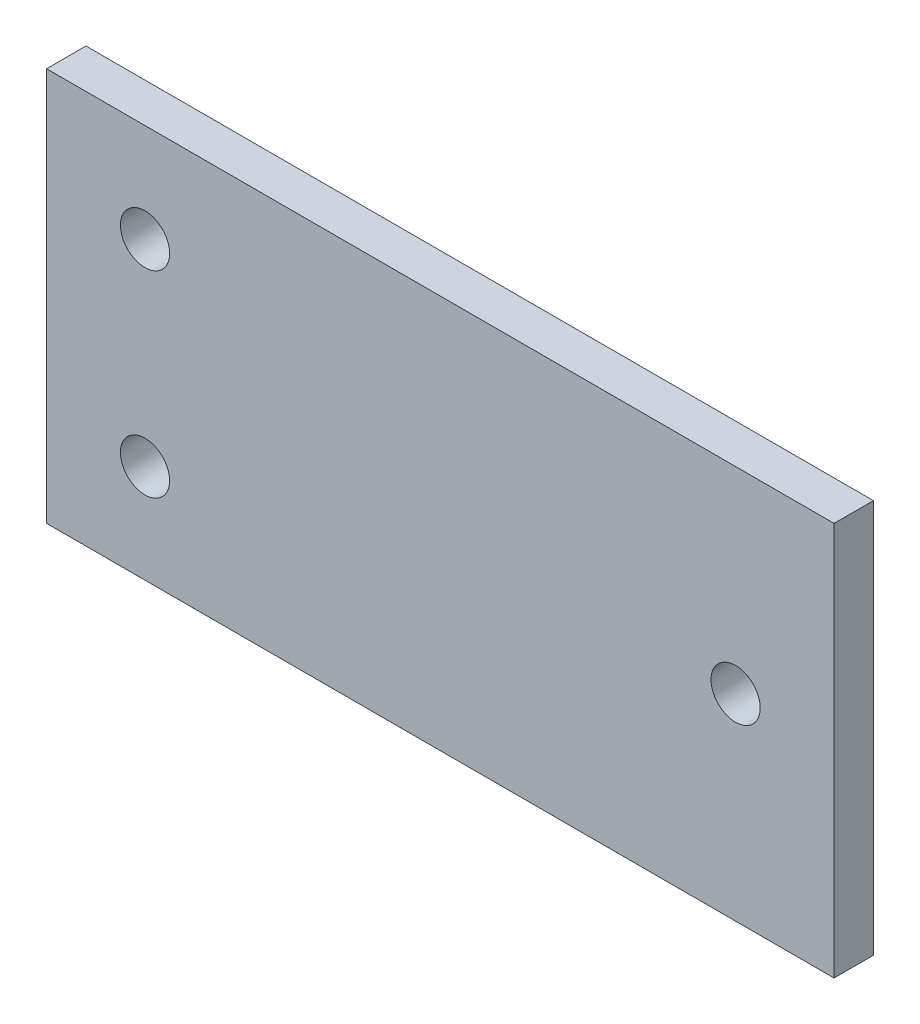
ISO-10303-21;
HEADER;
FILE_DESCRIPTION(('STEP AP214'),'2;1');
FILE_NAME('part.step','',(''),(''),'','','');
FILE_SCHEMA(('AUTOMOTIVE_DESIGN { 1 0 10303 214 1 1 1 1 }'));
ENDSEC;
DATA;
#1=APPLICATION_CONTEXT('core data for automotive mechanical design processes');
#2=APPLICATION_PROTOCOL_DEFINITION('international standard','automotive_design',2000,#1);
#3=PRODUCT_CONTEXT('',#1,'mechanical');
#4=PRODUCT('Part','Part','',(#3));
#5=PRODUCT_RELATED_PRODUCT_CATEGORY('part','',(#4));
#6=PRODUCT_DEFINITION_FORMATION('','',#4);
#7=PRODUCT_DEFINITION_CONTEXT('part definition',#1,'design');
#8=PRODUCT_DEFINITION('design','',#6,#7);
#9=PRODUCT_DEFINITION_SHAPE('','',#8);
#10=(LENGTH_UNIT() NAMED_UNIT(*) SI_UNIT(.MILLI.,.METRE.));
#11=(NAMED_UNIT(*) PLANE_ANGLE_UNIT() SI_UNIT($,.RADIAN.));
#12=(NAMED_UNIT(*) SI_UNIT($,.STERADIAN.) SOLID_ANGLE_UNIT());
#13=UNCERTAINTY_MEASURE_WITH_UNIT(LENGTH_MEASURE(1.E-05),#10,'distance_accuracy_value','');
#14=(GEOMETRIC_REPRESENTATION_CONTEXT(3) GLOBAL_UNCERTAINTY_ASSIGNED_CONTEXT((#13)) GLOBAL_UNIT_ASSIGNED_CONTEXT((#10,
#11,#12)) REPRESENTATION_CONTEXT('',''));
#15=CARTESIAN_POINT('',(0.,0.,0.));
#16=DIRECTION('',(0.,0.,1.));
#17=DIRECTION('',(1.,0.,0.));
#18=AXIS2_PLACEMENT_3D('',#15,#16,#17);
#19=CARTESIAN_POINT('',(0.,0.,8.));
#20=DIRECTION('',(0.,0.,-1.));
#21=DIRECTION('',(-1.,0.,0.));
#22=AXIS2_PLACEMENT_3D('',#19,#20,#21);
#23=PLANE('',#22);
#24=CARTESIAN_POINT('',(140.,40.,8.));
#25=DIRECTION('',(0.,0.,-1.));
#26=DIRECTION('',(-1.,0.,0.));
#27=AXIS2_PLACEMENT_3D('',#24,#25,#26);
#28=CIRCLE('',#27,5.);
#29=CARTESIAN_POINT('',(135.,40.,8.));
#30=VERTEX_POINT('',#29);
#31=EDGE_CURVE('E137',#30,#30,#28,.T.);
#32=ORIENTED_EDGE('',*,*,#31,.T.);
#33=EDGE_LOOP('',(#32));
#34=FACE_BOUND('',#33,.T.);
#35=DIRECTION('',(0.,-1.,0.));
#36=VECTOR('',#35,1.);
#37=CARTESIAN_POINT('',(0.,0.,8.));
#38=LINE('',#37,#36);
#39=CARTESIAN_POINT('',(0.,80.,8.));
#40=VERTEX_POINT('',#39);
#41=CARTESIAN_POINT('',(0.,0.,8.));
#42=VERTEX_POINT('',#41);
#43=EDGE_CURVE('E98',#40,#42,#38,.T.);
#44=ORIENTED_EDGE('',*,*,#43,.T.);
#45=DIRECTION('',(1.,0.,0.));
#46=VECTOR('',#45,1.);
#47=CARTESIAN_POINT('',(0.,0.,8.));
#48=LINE('',#47,#46);
#49=CARTESIAN_POINT('',(160.,0.,8.));
#50=VERTEX_POINT('',#49);
#51=EDGE_CURVE('E93',#42,#50,#48,.T.);
#52=ORIENTED_EDGE('',*,*,#51,.T.);
#53=DIRECTION('',(0.,1.,0.));
#54=VECTOR('',#53,1.);
#55=CARTESIAN_POINT('',(160.,0.,8.));
#56=LINE('',#55,#54);
#57=CARTESIAN_POINT('',(160.,80.,8.));
#58=VERTEX_POINT('',#57);
#59=EDGE_CURVE('E96',#50,#58,#56,.T.);
#60=ORIENTED_EDGE('',*,*,#59,.T.);
#61=DIRECTION('',(-1.,0.,0.));
#62=VECTOR('',#61,1.);
#63=CARTESIAN_POINT('',(0.,80.,8.));
#64=LINE('',#63,#62);
#65=EDGE_CURVE('E63',#58,#40,#64,.T.);
#66=ORIENTED_EDGE('',*,*,#65,.T.);
#67=EDGE_LOOP('',(#44,#52,#60,#66));
#68=FACE_BOUND('',#67,.T.);
#69=CARTESIAN_POINT('',(20.,60.,8.));
#70=DIRECTION('',(0.,0.,1.));
#71=DIRECTION('',(1.,0.,0.));
#72=AXIS2_PLACEMENT_3D('',#69,#70,#71);
#73=CIRCLE('',#72,5.);
#74=CARTESIAN_POINT('',(25.,60.,8.));
#75=VERTEX_POINT('',#74);
#76=EDGE_CURVE('E114',#75,#75,#73,.T.);
#77=ORIENTED_EDGE('',*,*,#76,.F.);
#78=EDGE_LOOP('',(#77));
#79=FACE_BOUND('',#78,.T.);
#80=CARTESIAN_POINT('',(20.,20.,8.));
#81=DIRECTION('',(0.,0.,1.));
#82=DIRECTION('',(1.,0.,0.));
#83=AXIS2_PLACEMENT_3D('',#80,#81,#82);
#84=CIRCLE('',#83,5.);
#85=CARTESIAN_POINT('',(25.,20.,8.));
#86=VERTEX_POINT('',#85);
#87=EDGE_CURVE('E131',#86,#86,#84,.T.);
#88=ORIENTED_EDGE('',*,*,#87,.F.);
#89=EDGE_LOOP('',(#88));
#90=FACE_BOUND('',#89,.T.);
#91=ADVANCED_FACE('F46',(#34,#68,#79,#90),#23,.F.);
#92=CARTESIAN_POINT('',(0.,0.,0.));
#93=DIRECTION('',(0.,0.,-1.));
#94=DIRECTION('',(-1.,0.,0.));
#95=AXIS2_PLACEMENT_3D('',#92,#93,#94);
#96=PLANE('',#95);
#97=CARTESIAN_POINT('',(140.,40.,0.));
#98=DIRECTION('',(0.,0.,-1.));
#99=DIRECTION('',(-1.,0.,0.));
#100=AXIS2_PLACEMENT_3D('',#97,#98,#99);
#101=CIRCLE('',#100,5.);
#102=CARTESIAN_POINT('',(135.,40.,0.));
#103=VERTEX_POINT('',#102);
#104=EDGE_CURVE('E142',#103,#103,#101,.T.);
#105=ORIENTED_EDGE('',*,*,#104,.F.);
#106=EDGE_LOOP('',(#105));
#107=FACE_BOUND('',#106,.T.);
#108=CARTESIAN_POINT('',(20.,60.,0.));
#109=DIRECTION('',(0.,0.,1.));
#110=DIRECTION('',(1.,0.,0.));
#111=AXIS2_PLACEMENT_3D('',#108,#109,#110);
#112=CIRCLE('',#111,5.);
#113=CARTESIAN_POINT('',(25.,60.,0.));
#114=VERTEX_POINT('',#113);
#115=EDGE_CURVE('E128',#114,#114,#112,.T.);
#116=ORIENTED_EDGE('',*,*,#115,.T.);
#117=EDGE_LOOP('',(#116));
#118=FACE_BOUND('',#117,.T.);
#119=DIRECTION('',(0.,-1.,0.));
#120=VECTOR('',#119,1.);
#121=CARTESIAN_POINT('',(0.,0.,0.));
#122=LINE('',#121,#120);
#123=CARTESIAN_POINT('',(0.,80.,0.));
#124=VERTEX_POINT('',#123);
#125=CARTESIAN_POINT('',(0.,0.,0.));
#126=VERTEX_POINT('',#125);
#127=EDGE_CURVE('E111',#124,#126,#122,.T.);
#128=ORIENTED_EDGE('',*,*,#127,.F.);
#129=DIRECTION('',(-1.,0.,0.));
#130=VECTOR('',#129,1.);
#131=CARTESIAN_POINT('',(0.,80.,0.));
#132=LINE('',#131,#130);
#133=CARTESIAN_POINT('',(160.,80.,0.));
#134=VERTEX_POINT('',#133);
#135=EDGE_CURVE('E86',#134,#124,#132,.T.);
#136=ORIENTED_EDGE('',*,*,#135,.F.);
#137=DIRECTION('',(0.,1.,0.));
#138=VECTOR('',#137,1.);
#139=CARTESIAN_POINT('',(160.,0.,0.));
#140=LINE('',#139,#138);
#141=CARTESIAN_POINT('',(160.,0.,0.));
#142=VERTEX_POINT('',#141);
#143=EDGE_CURVE('E80',#142,#134,#140,.T.);
#144=ORIENTED_EDGE('',*,*,#143,.F.);
#145=DIRECTION('',(1.,0.,0.));
#146=VECTOR('',#145,1.);
#147=CARTESIAN_POINT('',(0.,0.,0.));
#148=LINE('',#147,#146);
#149=EDGE_CURVE('E102',#126,#142,#148,.T.);
#150=ORIENTED_EDGE('',*,*,#149,.F.);
#151=EDGE_LOOP('',(#128,#136,#144,#150));
#152=FACE_BOUND('',#151,.T.);
#153=CARTESIAN_POINT('',(20.,20.,0.));
#154=DIRECTION('',(0.,0.,1.));
#155=DIRECTION('',(1.,0.,0.));
#156=AXIS2_PLACEMENT_3D('',#153,#154,#155);
#157=CIRCLE('',#156,5.);
#158=CARTESIAN_POINT('',(25.,20.,0.));
#159=VERTEX_POINT('',#158);
#160=EDGE_CURVE('E134',#159,#159,#157,.T.);
#161=ORIENTED_EDGE('',*,*,#160,.T.);
#162=EDGE_LOOP('',(#161));
#163=FACE_BOUND('',#162,.T.);
#164=ADVANCED_FACE('F124',(#107,#118,#152,#163),#96,.T.);
#165=CARTESIAN_POINT('',(0.,0.,8.));
#166=DIRECTION('',(1.,0.,0.));
#167=DIRECTION('',(0.,1.,0.));
#168=AXIS2_PLACEMENT_3D('',#165,#166,#167);
#169=PLANE('',#168);
#170=ORIENTED_EDGE('',*,*,#127,.T.);
#171=DIRECTION('',(0.,0.,-1.));
#172=VECTOR('',#171,1.);
#173=CARTESIAN_POINT('',(0.,0.,8.));
#174=LINE('',#173,#172);
#175=EDGE_CURVE('E12',#42,#126,#174,.T.);
#176=ORIENTED_EDGE('',*,*,#175,.F.);
#177=ORIENTED_EDGE('',*,*,#43,.F.);
#178=DIRECTION('',(0.,0.,-1.));
#179=VECTOR('',#178,1.);
#180=CARTESIAN_POINT('',(0.,80.,8.));
#181=LINE('',#180,#179);
#182=EDGE_CURVE('E106',#40,#124,#181,.T.);
#183=ORIENTED_EDGE('',*,*,#182,.T.);
#184=EDGE_LOOP('',(#170,#176,#177,#183));
#185=FACE_BOUND('',#184,.T.);
#186=ADVANCED_FACE('F48',(#185),#169,.F.);
#187=CARTESIAN_POINT('',(0.,0.,8.));
#188=DIRECTION('',(0.,1.,0.));
#189=DIRECTION('',(0.,0.,1.));
#190=AXIS2_PLACEMENT_3D('',#187,#188,#189);
#191=PLANE('',#190);
#192=ORIENTED_EDGE('',*,*,#149,.T.);
#193=DIRECTION('',(0.,0.,-1.));
#194=VECTOR('',#193,1.);
#195=CARTESIAN_POINT('',(160.,0.,8.));
#196=LINE('',#195,#194);
#197=EDGE_CURVE('E55',#50,#142,#196,.T.);
#198=ORIENTED_EDGE('',*,*,#197,.F.);
#199=ORIENTED_EDGE('',*,*,#51,.F.);
#200=ORIENTED_EDGE('',*,*,#175,.T.);
#201=EDGE_LOOP('',(#192,#198,#199,#200));
#202=FACE_BOUND('',#201,.T.);
#203=ADVANCED_FACE('F101',(#202),#191,.F.);
#204=CARTESIAN_POINT('',(160.,0.,8.));
#205=DIRECTION('',(-1.,0.,0.));
#206=DIRECTION('',(0.,0.,1.));
#207=AXIS2_PLACEMENT_3D('',#204,#205,#206);
#208=PLANE('',#207);
#209=ORIENTED_EDGE('',*,*,#143,.T.);
#210=DIRECTION('',(0.,0.,-1.));
#211=VECTOR('',#210,1.);
#212=CARTESIAN_POINT('',(160.,80.,8.));
#213=LINE('',#212,#211);
#214=EDGE_CURVE('E103',#58,#134,#213,.T.);
#215=ORIENTED_EDGE('',*,*,#214,.F.);
#216=ORIENTED_EDGE('',*,*,#59,.F.);
#217=ORIENTED_EDGE('',*,*,#197,.T.);
#218=EDGE_LOOP('',(#209,#215,#216,#217));
#219=FACE_BOUND('',#218,.T.);
#220=ADVANCED_FACE('F104',(#219),#208,.F.);
#221=CARTESIAN_POINT('',(0.,80.,8.));
#222=DIRECTION('',(0.,-1.,0.));
#223=DIRECTION('',(0.,0.,-1.));
#224=AXIS2_PLACEMENT_3D('',#221,#222,#223);
#225=PLANE('',#224);
#226=ORIENTED_EDGE('',*,*,#135,.T.);
#227=ORIENTED_EDGE('',*,*,#182,.F.);
#228=ORIENTED_EDGE('',*,*,#65,.F.);
#229=ORIENTED_EDGE('',*,*,#214,.T.);
#230=EDGE_LOOP('',(#226,#227,#228,#229));
#231=FACE_BOUND('',#230,.T.);
#232=ADVANCED_FACE('F121',(#231),#225,.F.);
#233=CARTESIAN_POINT('',(20.,60.,8.));
#234=DIRECTION('',(0.,0.,-1.));
#235=DIRECTION('',(-1.,0.,0.));
#236=AXIS2_PLACEMENT_3D('',#233,#234,#235);
#237=CYLINDRICAL_SURFACE('',#236,5.);
#238=ORIENTED_EDGE('',*,*,#76,.T.);
#239=EDGE_LOOP('',(#238));
#240=FACE_BOUND('',#239,.T.);
#241=ORIENTED_EDGE('',*,*,#115,.F.);
#242=EDGE_LOOP('',(#241));
#243=FACE_BOUND('',#242,.T.);
#244=ADVANCED_FACE('F153',(#240,#243),#237,.F.);
#245=CARTESIAN_POINT('',(20.,20.,8.));
#246=DIRECTION('',(0.,0.,-1.));
#247=DIRECTION('',(-1.,0.,0.));
#248=AXIS2_PLACEMENT_3D('',#245,#246,#247);
#249=CYLINDRICAL_SURFACE('',#248,5.);
#250=ORIENTED_EDGE('',*,*,#87,.T.);
#251=EDGE_LOOP('',(#250));
#252=FACE_BOUND('',#251,.T.);
#253=ORIENTED_EDGE('',*,*,#160,.F.);
#254=EDGE_LOOP('',(#253));
#255=FACE_BOUND('',#254,.T.);
#256=ADVANCED_FACE('F155',(#252,#255),#249,.F.);
#257=CARTESIAN_POINT('',(140.,40.,0.));
#258=DIRECTION('',(0.,0.,-1.));
#259=DIRECTION('',(-1.,0.,0.));
#260=AXIS2_PLACEMENT_3D('',#257,#258,#259);
#261=CYLINDRICAL_SURFACE('',#260,5.);
#262=ORIENTED_EDGE('',*,*,#31,.F.);
#263=EDGE_LOOP('',(#262));
#264=FACE_BOUND('',#263,.T.);
#265=ORIENTED_EDGE('',*,*,#104,.T.);
#266=EDGE_LOOP('',(#265));
#267=FACE_BOUND('',#266,.T.);
#268=ADVANCED_FACE('F146',(#264,#267),#261,.F.);
#269=CLOSED_SHELL('',(#91,#164,#186,#203,#220,#232,#244,#256,#268));
#270=MANIFOLD_SOLID_BREP('B2',#269);
#271=ADVANCED_BREP_SHAPE_REPRESENTATION('',(#18,#270),#14);
#272=SHAPE_DEFINITION_REPRESENTATION(#9,#271);
ENDSEC;
END-ISO-10303-21;
